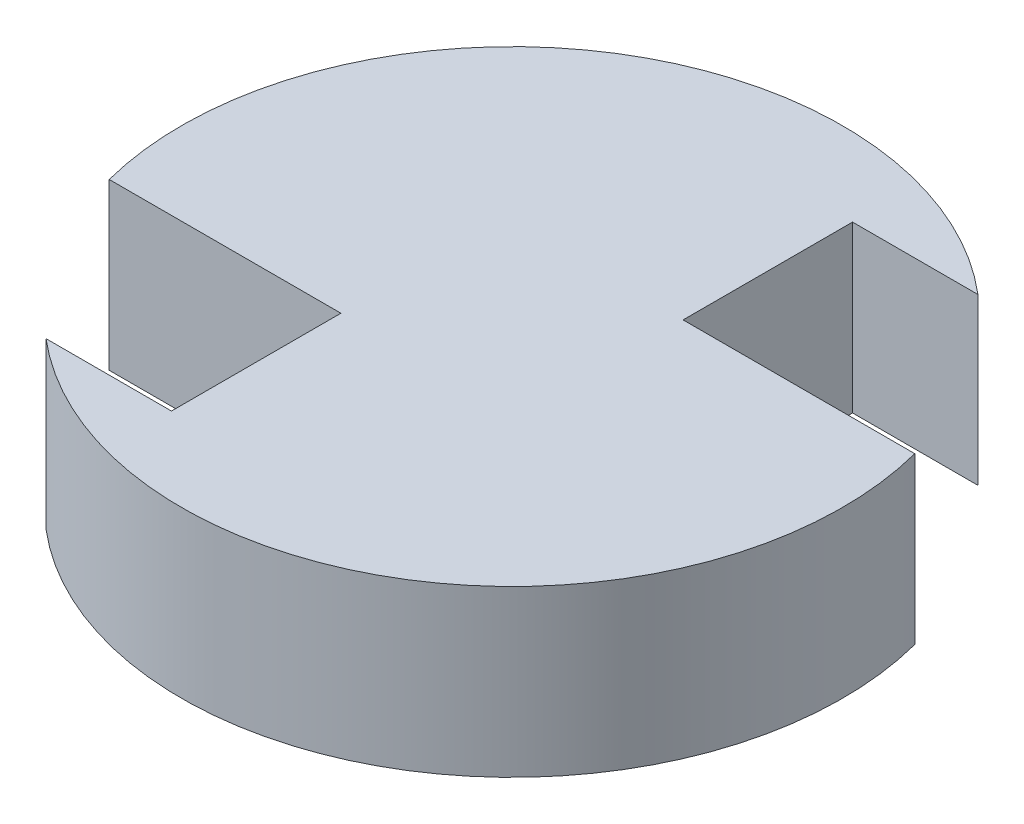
ISO-10303-21;
HEADER;
FILE_DESCRIPTION(('STEP AP214'),'2;1');
FILE_NAME('part.step','',(''),(''),'','','');
FILE_SCHEMA(('AUTOMOTIVE_DESIGN { 1 0 10303 214 1 1 1 1 }'));
ENDSEC;
DATA;
#1=APPLICATION_CONTEXT('core data for automotive mechanical design processes');
#2=APPLICATION_PROTOCOL_DEFINITION('international standard','automotive_design',2000,#1);
#3=PRODUCT_CONTEXT('',#1,'mechanical');
#4=PRODUCT('Part','Part','',(#3));
#5=PRODUCT_RELATED_PRODUCT_CATEGORY('part','',(#4));
#6=PRODUCT_DEFINITION_FORMATION('','',#4);
#7=PRODUCT_DEFINITION_CONTEXT('part definition',#1,'design');
#8=PRODUCT_DEFINITION('design','',#6,#7);
#9=PRODUCT_DEFINITION_SHAPE('','',#8);
#10=(LENGTH_UNIT() NAMED_UNIT(*) SI_UNIT(.MILLI.,.METRE.));
#11=(NAMED_UNIT(*) PLANE_ANGLE_UNIT() SI_UNIT($,.RADIAN.));
#12=(NAMED_UNIT(*) SI_UNIT($,.STERADIAN.) SOLID_ANGLE_UNIT());
#13=UNCERTAINTY_MEASURE_WITH_UNIT(LENGTH_MEASURE(1.E-05),#10,'distance_accuracy_value','');
#14=(GEOMETRIC_REPRESENTATION_CONTEXT(3) GLOBAL_UNCERTAINTY_ASSIGNED_CONTEXT((#13)) GLOBAL_UNIT_ASSIGNED_CONTEXT((#10,
#11,#12)) REPRESENTATION_CONTEXT('',''));
#15=CARTESIAN_POINT('',(0.,0.,0.));
#16=DIRECTION('',(0.,0.,1.));
#17=DIRECTION('',(1.,0.,0.));
#18=AXIS2_PLACEMENT_3D('',#15,#16,#17);
#19=CARTESIAN_POINT('',(0.,4.,-6.1));
#20=DIRECTION('',(0.,0.,-1.));
#21=DIRECTION('',(-1.,0.,0.));
#22=AXIS2_PLACEMENT_3D('',#19,#20,#21);
#23=PLANE('',#22);
#24=DIRECTION('',(1.,0.,0.));
#25=VECTOR('',#24,1.);
#26=CARTESIAN_POINT('',(0.,0.,-6.1));
#27=LINE('',#26,#25);
#28=CARTESIAN_POINT('',(2.1400437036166,0.,-6.1));
#29=VERTEX_POINT('',#28);
#30=CARTESIAN_POINT('',(5.17590571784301,0.,-6.1));
#31=VERTEX_POINT('',#30);
#32=EDGE_CURVE('E140',#29,#31,#27,.T.);
#33=ORIENTED_EDGE('',*,*,#32,.T.);
#34=DIRECTION('',(0.,-1.,0.));
#35=VECTOR('',#34,1.);
#36=CARTESIAN_POINT('',(5.17590571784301,4.,-6.1));
#37=LINE('',#36,#35);
#38=CARTESIAN_POINT('',(5.17590571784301,4.,-6.1));
#39=VERTEX_POINT('',#38);
#40=EDGE_CURVE('E11',#39,#31,#37,.T.);
#41=ORIENTED_EDGE('',*,*,#40,.F.);
#42=DIRECTION('',(1.,0.,0.));
#43=VECTOR('',#42,1.);
#44=CARTESIAN_POINT('',(0.,4.,-6.1));
#45=LINE('',#44,#43);
#46=CARTESIAN_POINT('',(2.1400437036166,4.,-6.1));
#47=VERTEX_POINT('',#46);
#48=EDGE_CURVE('E162',#47,#39,#45,.T.);
#49=ORIENTED_EDGE('',*,*,#48,.F.);
#50=DIRECTION('',(0.,-1.,0.));
#51=VECTOR('',#50,1.);
#52=CARTESIAN_POINT('',(2.1400437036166,4.,-6.1));
#53=LINE('',#52,#51);
#54=EDGE_CURVE('E136',#47,#29,#53,.T.);
#55=ORIENTED_EDGE('',*,*,#54,.T.);
#56=EDGE_LOOP('',(#33,#41,#49,#55));
#57=FACE_BOUND('',#56,.T.);
#58=ADVANCED_FACE('F39',(#57),#23,.F.);
#59=CARTESIAN_POINT('',(0.,4.,0.));
#60=DIRECTION('',(0.,-1.,0.));
#61=DIRECTION('',(0.,0.,-1.));
#62=AXIS2_PLACEMENT_3D('',#59,#60,#61);
#63=CYLINDRICAL_SURFACE('',#62,8.);
#64=CARTESIAN_POINT('',(0.,0.,0.));
#65=DIRECTION('',(0.,1.,0.));
#66=DIRECTION('',(0.,0.,1.));
#67=AXIS2_PLACEMENT_3D('',#64,#65,#66);
#68=CIRCLE('',#67,8.);
#69=CARTESIAN_POINT('',(-7.74596669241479,0.,2.00000000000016));
#70=VERTEX_POINT('',#69);
#71=EDGE_CURVE('E144',#31,#70,#68,.T.);
#72=ORIENTED_EDGE('',*,*,#71,.T.);
#73=DIRECTION('',(0.,-1.,0.));
#74=VECTOR('',#73,1.);
#75=CARTESIAN_POINT('',(-7.74596669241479,4.,2.00000000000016));
#76=LINE('',#75,#74);
#77=CARTESIAN_POINT('',(-7.74596669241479,4.,2.00000000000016));
#78=VERTEX_POINT('',#77);
#79=EDGE_CURVE('E48',#78,#70,#76,.T.);
#80=ORIENTED_EDGE('',*,*,#79,.F.);
#81=CARTESIAN_POINT('',(0.,4.,0.));
#82=DIRECTION('',(0.,1.,0.));
#83=DIRECTION('',(0.,0.,1.));
#84=AXIS2_PLACEMENT_3D('',#81,#82,#83);
#85=CIRCLE('',#84,8.);
#86=EDGE_CURVE('E99',#39,#78,#85,.T.);
#87=ORIENTED_EDGE('',*,*,#86,.F.);
#88=ORIENTED_EDGE('',*,*,#40,.T.);
#89=EDGE_LOOP('',(#72,#80,#87,#88));
#90=FACE_BOUND('',#89,.T.);
#91=ADVANCED_FACE('F208',(#90),#63,.T.);
#92=CARTESIAN_POINT('',(0.,4.,2.00000000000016));
#93=DIRECTION('',(0.,0.,-1.));
#94=DIRECTION('',(-1.,0.,0.));
#95=AXIS2_PLACEMENT_3D('',#92,#93,#94);
#96=PLANE('',#95);
#97=DIRECTION('',(1.,0.,0.));
#98=VECTOR('',#97,1.);
#99=CARTESIAN_POINT('',(0.,0.,2.00000000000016));
#100=LINE('',#99,#98);
#101=CARTESIAN_POINT('',(-2.14004370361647,0.,2.00000000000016));
#102=VERTEX_POINT('',#101);
#103=EDGE_CURVE('E147',#70,#102,#100,.T.);
#104=ORIENTED_EDGE('',*,*,#103,.T.);
#105=DIRECTION('',(0.,-1.,0.));
#106=VECTOR('',#105,1.);
#107=CARTESIAN_POINT('',(-2.14004370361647,4.,2.00000000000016));
#108=LINE('',#107,#106);
#109=CARTESIAN_POINT('',(-2.14004370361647,4.,2.00000000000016));
#110=VERTEX_POINT('',#109);
#111=EDGE_CURVE('E173',#110,#102,#108,.T.);
#112=ORIENTED_EDGE('',*,*,#111,.F.);
#113=DIRECTION('',(1.,0.,0.));
#114=VECTOR('',#113,1.);
#115=CARTESIAN_POINT('',(0.,4.,2.00000000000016));
#116=LINE('',#115,#114);
#117=EDGE_CURVE('E183',#78,#110,#116,.T.);
#118=ORIENTED_EDGE('',*,*,#117,.F.);
#119=ORIENTED_EDGE('',*,*,#79,.T.);
#120=EDGE_LOOP('',(#104,#112,#118,#119));
#121=FACE_BOUND('',#120,.T.);
#122=ADVANCED_FACE('F181',(#121),#96,.F.);
#123=CARTESIAN_POINT('',(-2.14004370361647,4.,0.));
#124=DIRECTION('',(1.,0.,0.));
#125=DIRECTION('',(0.,0.,-1.));
#126=AXIS2_PLACEMENT_3D('',#123,#124,#125);
#127=PLANE('',#126);
#128=DIRECTION('',(0.,0.,1.));
#129=VECTOR('',#128,1.);
#130=CARTESIAN_POINT('',(-2.14004370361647,0.,0.));
#131=LINE('',#130,#129);
#132=CARTESIAN_POINT('',(-2.14004370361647,0.,6.10000000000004));
#133=VERTEX_POINT('',#132);
#134=EDGE_CURVE('E150',#102,#133,#131,.T.);
#135=ORIENTED_EDGE('',*,*,#134,.T.);
#136=DIRECTION('',(0.,-1.,0.));
#137=VECTOR('',#136,1.);
#138=CARTESIAN_POINT('',(-2.14004370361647,4.,6.10000000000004));
#139=LINE('',#138,#137);
#140=CARTESIAN_POINT('',(-2.14004370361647,4.,6.10000000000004));
#141=VERTEX_POINT('',#140);
#142=EDGE_CURVE('E169',#141,#133,#139,.T.);
#143=ORIENTED_EDGE('',*,*,#142,.F.);
#144=DIRECTION('',(0.,0.,1.));
#145=VECTOR('',#144,1.);
#146=CARTESIAN_POINT('',(-2.14004370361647,4.,0.));
#147=LINE('',#146,#145);
#148=EDGE_CURVE('E196',#110,#141,#147,.T.);
#149=ORIENTED_EDGE('',*,*,#148,.F.);
#150=ORIENTED_EDGE('',*,*,#111,.T.);
#151=EDGE_LOOP('',(#135,#143,#149,#150));
#152=FACE_BOUND('',#151,.T.);
#153=ADVANCED_FACE('F191',(#152),#127,.F.);
#154=CARTESIAN_POINT('',(1.27224551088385E-13,4.,6.1));
#155=DIRECTION('',(0.,0.,1.));
#156=DIRECTION('',(1.,0.,0.));
#157=AXIS2_PLACEMENT_3D('',#154,#155,#156);
#158=PLANE('',#157);
#159=DIRECTION('',(-1.,0.,0.));
#160=VECTOR('',#159,1.);
#161=CARTESIAN_POINT('',(1.27224551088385E-13,0.,6.1));
#162=LINE('',#161,#160);
#163=CARTESIAN_POINT('',(-5.17590571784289,0.,6.10000000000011));
#164=VERTEX_POINT('',#163);
#165=EDGE_CURVE('E153',#133,#164,#162,.T.);
#166=ORIENTED_EDGE('',*,*,#165,.T.);
#167=DIRECTION('',(0.,-1.,0.));
#168=VECTOR('',#167,1.);
#169=CARTESIAN_POINT('',(-5.17590571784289,4.,6.10000000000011));
#170=LINE('',#169,#168);
#171=CARTESIAN_POINT('',(-5.17590571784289,4.,6.10000000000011));
#172=VERTEX_POINT('',#171);
#173=EDGE_CURVE('E129',#172,#164,#170,.T.);
#174=ORIENTED_EDGE('',*,*,#173,.F.);
#175=DIRECTION('',(-1.,0.,0.));
#176=VECTOR('',#175,1.);
#177=CARTESIAN_POINT('',(1.27224551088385E-13,4.,6.1));
#178=LINE('',#177,#176);
#179=EDGE_CURVE('E118',#141,#172,#178,.T.);
#180=ORIENTED_EDGE('',*,*,#179,.F.);
#181=ORIENTED_EDGE('',*,*,#142,.T.);
#182=EDGE_LOOP('',(#166,#174,#180,#181));
#183=FACE_BOUND('',#182,.T.);
#184=ADVANCED_FACE('F194',(#183),#158,.F.);
#185=CARTESIAN_POINT('',(0.,4.,0.));
#186=DIRECTION('',(0.,-1.,0.));
#187=DIRECTION('',(0.,0.,-1.));
#188=AXIS2_PLACEMENT_3D('',#185,#186,#187);
#189=CYLINDRICAL_SURFACE('',#188,8.);
#190=CARTESIAN_POINT('',(0.,0.,0.));
#191=DIRECTION('',(0.,1.,0.));
#192=DIRECTION('',(0.,0.,1.));
#193=AXIS2_PLACEMENT_3D('',#190,#191,#192);
#194=CIRCLE('',#193,8.);
#195=CARTESIAN_POINT('',(7.74596669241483,0.,-2.));
#196=VERTEX_POINT('',#195);
#197=EDGE_CURVE('E127',#164,#196,#194,.T.);
#198=ORIENTED_EDGE('',*,*,#197,.T.);
#199=DIRECTION('',(0.,-1.,0.));
#200=VECTOR('',#199,1.);
#201=CARTESIAN_POINT('',(7.74596669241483,4.,-2.));
#202=LINE('',#201,#200);
#203=CARTESIAN_POINT('',(7.74596669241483,4.,-2.));
#204=VERTEX_POINT('',#203);
#205=EDGE_CURVE('E124',#204,#196,#202,.T.);
#206=ORIENTED_EDGE('',*,*,#205,.F.);
#207=CARTESIAN_POINT('',(0.,4.,0.));
#208=DIRECTION('',(0.,1.,0.));
#209=DIRECTION('',(0.,0.,1.));
#210=AXIS2_PLACEMENT_3D('',#207,#208,#209);
#211=CIRCLE('',#210,8.);
#212=EDGE_CURVE('E112',#172,#204,#211,.T.);
#213=ORIENTED_EDGE('',*,*,#212,.F.);
#214=ORIENTED_EDGE('',*,*,#173,.T.);
#215=EDGE_LOOP('',(#198,#206,#213,#214));
#216=FACE_BOUND('',#215,.T.);
#217=ADVANCED_FACE('F125',(#216),#189,.T.);
#218=CARTESIAN_POINT('',(0.,4.,-2.));
#219=DIRECTION('',(0.,0.,1.));
#220=DIRECTION('',(1.,0.,0.));
#221=AXIS2_PLACEMENT_3D('',#218,#219,#220);
#222=PLANE('',#221);
#223=DIRECTION('',(-1.,0.,0.));
#224=VECTOR('',#223,1.);
#225=CARTESIAN_POINT('',(0.,0.,-2.));
#226=LINE('',#225,#224);
#227=CARTESIAN_POINT('',(2.1400437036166,0.,-2.));
#228=VERTEX_POINT('',#227);
#229=EDGE_CURVE('E85',#196,#228,#226,.T.);
#230=ORIENTED_EDGE('',*,*,#229,.T.);
#231=DIRECTION('',(0.,-1.,0.));
#232=VECTOR('',#231,1.);
#233=CARTESIAN_POINT('',(2.1400437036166,4.,-2.));
#234=LINE('',#233,#232);
#235=CARTESIAN_POINT('',(2.1400437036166,4.,-2.));
#236=VERTEX_POINT('',#235);
#237=EDGE_CURVE('E130',#236,#228,#234,.T.);
#238=ORIENTED_EDGE('',*,*,#237,.F.);
#239=DIRECTION('',(-1.,0.,0.));
#240=VECTOR('',#239,1.);
#241=CARTESIAN_POINT('',(0.,4.,-2.));
#242=LINE('',#241,#240);
#243=EDGE_CURVE('E116',#204,#236,#242,.T.);
#244=ORIENTED_EDGE('',*,*,#243,.F.);
#245=ORIENTED_EDGE('',*,*,#205,.T.);
#246=EDGE_LOOP('',(#230,#238,#244,#245));
#247=FACE_BOUND('',#246,.T.);
#248=ADVANCED_FACE('F132',(#247),#222,.F.);
#249=CARTESIAN_POINT('',(2.1400437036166,4.,0.));
#250=DIRECTION('',(-1.,0.,0.));
#251=DIRECTION('',(0.,0.,1.));
#252=AXIS2_PLACEMENT_3D('',#249,#250,#251);
#253=PLANE('',#252);
#254=DIRECTION('',(0.,0.,-1.));
#255=VECTOR('',#254,1.);
#256=CARTESIAN_POINT('',(2.1400437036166,0.,0.));
#257=LINE('',#256,#255);
#258=EDGE_CURVE('E91',#228,#29,#257,.T.);
#259=ORIENTED_EDGE('',*,*,#258,.T.);
#260=ORIENTED_EDGE('',*,*,#54,.F.);
#261=DIRECTION('',(0.,0.,-1.));
#262=VECTOR('',#261,1.);
#263=CARTESIAN_POINT('',(2.1400437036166,4.,0.));
#264=LINE('',#263,#262);
#265=EDGE_CURVE('E56',#236,#47,#264,.T.);
#266=ORIENTED_EDGE('',*,*,#265,.F.);
#267=ORIENTED_EDGE('',*,*,#237,.T.);
#268=EDGE_LOOP('',(#259,#260,#266,#267));
#269=FACE_BOUND('',#268,.T.);
#270=ADVANCED_FACE('F224',(#269),#253,.F.);
#271=CARTESIAN_POINT('',(0.,4.,0.));
#272=DIRECTION('',(0.,1.,0.));
#273=DIRECTION('',(0.,0.,1.));
#274=AXIS2_PLACEMENT_3D('',#271,#272,#273);
#275=PLANE('',#274);
#276=ORIENTED_EDGE('',*,*,#48,.T.);
#277=ORIENTED_EDGE('',*,*,#86,.T.);
#278=ORIENTED_EDGE('',*,*,#117,.T.);
#279=ORIENTED_EDGE('',*,*,#148,.T.);
#280=ORIENTED_EDGE('',*,*,#179,.T.);
#281=ORIENTED_EDGE('',*,*,#212,.T.);
#282=ORIENTED_EDGE('',*,*,#243,.T.);
#283=ORIENTED_EDGE('',*,*,#265,.T.);
#284=EDGE_LOOP('',(#276,#277,#278,#279,#280,#281,#282,#283));
#285=FACE_BOUND('',#284,.T.);
#286=ADVANCED_FACE('F114',(#285),#275,.T.);
#287=CARTESIAN_POINT('',(0.,0.,0.));
#288=DIRECTION('',(0.,1.,0.));
#289=DIRECTION('',(0.,0.,1.));
#290=AXIS2_PLACEMENT_3D('',#287,#288,#289);
#291=PLANE('',#290);
#292=ORIENTED_EDGE('',*,*,#32,.F.);
#293=ORIENTED_EDGE('',*,*,#258,.F.);
#294=ORIENTED_EDGE('',*,*,#229,.F.);
#295=ORIENTED_EDGE('',*,*,#197,.F.);
#296=ORIENTED_EDGE('',*,*,#165,.F.);
#297=ORIENTED_EDGE('',*,*,#134,.F.);
#298=ORIENTED_EDGE('',*,*,#103,.F.);
#299=ORIENTED_EDGE('',*,*,#71,.F.);
#300=EDGE_LOOP('',(#292,#293,#294,#295,#296,#297,#298,#299));
#301=FACE_BOUND('',#300,.T.);
#302=ADVANCED_FACE('F187',(#301),#291,.F.);
#303=CLOSED_SHELL('',(#58,#91,#122,#153,#184,#217,#248,#270,#286,#302));
#304=MANIFOLD_SOLID_BREP('B2',#303);
#305=ADVANCED_BREP_SHAPE_REPRESENTATION('',(#18,#304),#14);
#306=SHAPE_DEFINITION_REPRESENTATION(#9,#305);
ENDSEC;
END-ISO-10303-21;
